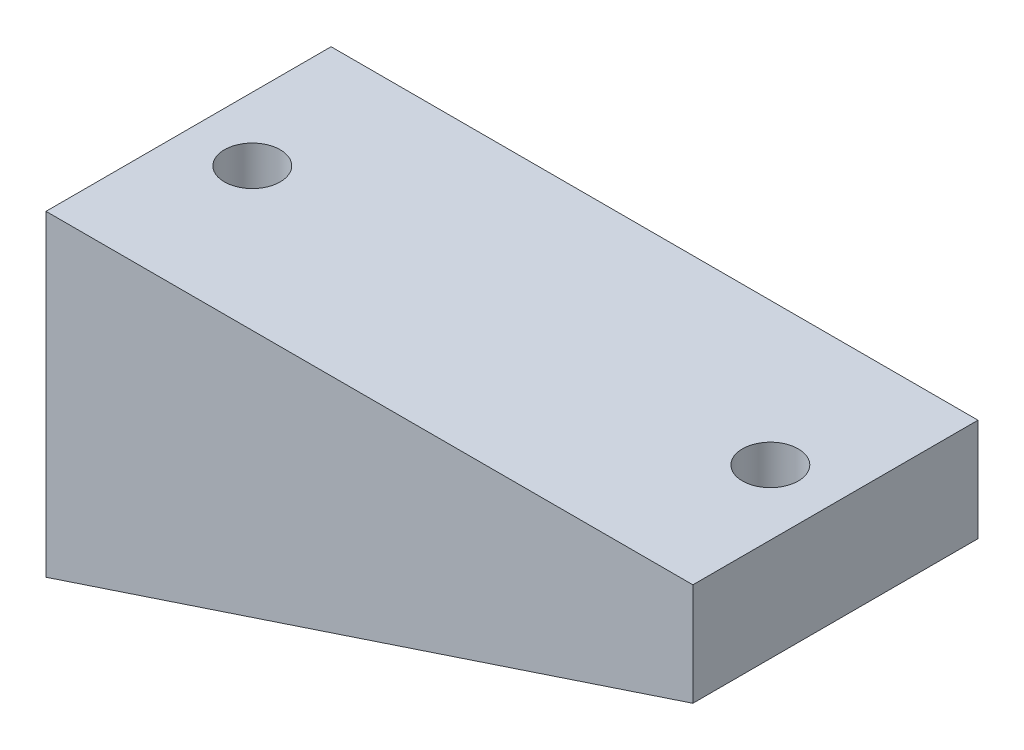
ISO-10303-21;
HEADER;
FILE_DESCRIPTION(('STEP AP214'),'2;1');
FILE_NAME('part.step','',(''),(''),'','','');
FILE_SCHEMA(('AUTOMOTIVE_DESIGN { 1 0 10303 214 1 1 1 1 }'));
ENDSEC;
DATA;
#1=APPLICATION_CONTEXT('core data for automotive mechanical design processes');
#2=APPLICATION_PROTOCOL_DEFINITION('international standard','automotive_design',2000,#1);
#3=PRODUCT_CONTEXT('',#1,'mechanical');
#4=PRODUCT('Part','Part','',(#3));
#5=PRODUCT_RELATED_PRODUCT_CATEGORY('part','',(#4));
#6=PRODUCT_DEFINITION_FORMATION('','',#4);
#7=PRODUCT_DEFINITION_CONTEXT('part definition',#1,'design');
#8=PRODUCT_DEFINITION('design','',#6,#7);
#9=PRODUCT_DEFINITION_SHAPE('','',#8);
#10=(LENGTH_UNIT() NAMED_UNIT(*) SI_UNIT(.MILLI.,.METRE.));
#11=(NAMED_UNIT(*) PLANE_ANGLE_UNIT() SI_UNIT($,.RADIAN.));
#12=(NAMED_UNIT(*) SI_UNIT($,.STERADIAN.) SOLID_ANGLE_UNIT());
#13=UNCERTAINTY_MEASURE_WITH_UNIT(LENGTH_MEASURE(1.E-05),#10,'distance_accuracy_value','');
#14=(GEOMETRIC_REPRESENTATION_CONTEXT(3) GLOBAL_UNCERTAINTY_ASSIGNED_CONTEXT((#13)) GLOBAL_UNIT_ASSIGNED_CONTEXT((#10,
#11,#12)) REPRESENTATION_CONTEXT('',''));
#15=CARTESIAN_POINT('',(0.,0.,0.));
#16=DIRECTION('',(0.,0.,1.));
#17=DIRECTION('',(1.,0.,0.));
#18=AXIS2_PLACEMENT_3D('',#15,#16,#17);
#19=CARTESIAN_POINT('',(120.25046854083,58.9096385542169,26.5));
#20=DIRECTION('',(0.,-1.,0.));
#21=DIRECTION('',(1.,0.,0.));
#22=AXIS2_PLACEMENT_3D('',#19,#20,#21);
#23=PLANE('',#22);
#24=DIRECTION('',(-1.,0.,0.));
#25=VECTOR('',#24,1.);
#26=CARTESIAN_POINT('',(120.25046854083,58.9096385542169,-26.5));
#27=LINE('',#26,#25);
#28=CARTESIAN_POINT('',(120.25046854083,58.9096385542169,-26.5));
#29=VERTEX_POINT('',#28);
#30=CARTESIAN_POINT('',(0.,58.9096385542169,-26.5));
#31=VERTEX_POINT('',#30);
#32=EDGE_CURVE('E102',#29,#31,#27,.T.);
#33=ORIENTED_EDGE('',*,*,#32,.T.);
#34=DIRECTION('',(0.,0.,-1.));
#35=VECTOR('',#34,1.);
#36=CARTESIAN_POINT('',(0.,58.9096385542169,26.5));
#37=LINE('',#36,#35);
#38=CARTESIAN_POINT('',(0.,58.9096385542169,26.5));
#39=VERTEX_POINT('',#38);
#40=EDGE_CURVE('E93',#39,#31,#37,.T.);
#41=ORIENTED_EDGE('',*,*,#40,.F.);
#42=DIRECTION('',(-1.,0.,0.));
#43=VECTOR('',#42,1.);
#44=CARTESIAN_POINT('',(120.25046854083,58.9096385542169,26.5));
#45=LINE('',#44,#43);
#46=CARTESIAN_POINT('',(120.25046854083,58.9096385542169,26.5));
#47=VERTEX_POINT('',#46);
#48=EDGE_CURVE('E51',#47,#39,#45,.T.);
#49=ORIENTED_EDGE('',*,*,#48,.F.);
#50=DIRECTION('',(0.,0.,-1.));
#51=VECTOR('',#50,1.);
#52=CARTESIAN_POINT('',(120.25046854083,58.9096385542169,26.5));
#53=LINE('',#52,#51);
#54=EDGE_CURVE('E110',#47,#29,#53,.T.);
#55=ORIENTED_EDGE('',*,*,#54,.T.);
#56=EDGE_LOOP('',(#33,#41,#49,#55));
#57=FACE_BOUND('',#56,.T.);
#58=CARTESIAN_POINT('',(108.150298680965,58.9096385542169,0.));
#59=DIRECTION('',(0.,1.,0.));
#60=DIRECTION('',(-1.,0.,0.));
#61=AXIS2_PLACEMENT_3D('',#58,#59,#60);
#62=CIRCLE('',#61,5.18706468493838);
#63=CARTESIAN_POINT('',(102.963233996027,58.9096385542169,0.));
#64=VERTEX_POINT('',#63);
#65=EDGE_CURVE('E97',#64,#64,#62,.T.);
#66=ORIENTED_EDGE('',*,*,#65,.F.);
#67=EDGE_LOOP('',(#66));
#68=FACE_BOUND('',#67,.T.);
#69=CARTESIAN_POINT('',(11.8497013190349,58.9096385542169,0.));
#70=DIRECTION('',(0.,-1.,0.));
#71=DIRECTION('',(1.,0.,0.));
#72=AXIS2_PLACEMENT_3D('',#69,#70,#71);
#73=CIRCLE('',#72,5.18706468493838);
#74=CARTESIAN_POINT('',(17.0367660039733,58.9096385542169,0.));
#75=VERTEX_POINT('',#74);
#76=EDGE_CURVE('E200',#75,#75,#73,.T.);
#77=ORIENTED_EDGE('',*,*,#76,.T.);
#78=EDGE_LOOP('',(#77));
#79=FACE_BOUND('',#78,.T.);
#80=ADVANCED_FACE('F36',(#57,#68,#79),#23,.F.);
#81=CARTESIAN_POINT('',(0.,58.9096385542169,26.5));
#82=DIRECTION('',(1.,0.,0.));
#83=DIRECTION('',(0.,0.,-1.));
#84=AXIS2_PLACEMENT_3D('',#81,#82,#83);
#85=PLANE('',#84);
#86=DIRECTION('',(0.,-1.,0.));
#87=VECTOR('',#86,1.);
#88=CARTESIAN_POINT('',(0.,58.9096385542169,-26.5));
#89=LINE('',#88,#87);
#90=CARTESIAN_POINT('',(0.,0.,-26.5));
#91=VERTEX_POINT('',#90);
#92=EDGE_CURVE('E81',#31,#91,#89,.T.);
#93=ORIENTED_EDGE('',*,*,#92,.T.);
#94=DIRECTION('',(0.,0.,-1.));
#95=VECTOR('',#94,1.);
#96=CARTESIAN_POINT('',(0.,0.,26.5));
#97=LINE('',#96,#95);
#98=CARTESIAN_POINT('',(0.,0.,26.5));
#99=VERTEX_POINT('',#98);
#100=EDGE_CURVE('E12',#99,#91,#97,.T.);
#101=ORIENTED_EDGE('',*,*,#100,.F.);
#102=DIRECTION('',(0.,-1.,0.));
#103=VECTOR('',#102,1.);
#104=CARTESIAN_POINT('',(0.,58.9096385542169,26.5));
#105=LINE('',#104,#103);
#106=EDGE_CURVE('E104',#39,#99,#105,.T.);
#107=ORIENTED_EDGE('',*,*,#106,.F.);
#108=ORIENTED_EDGE('',*,*,#40,.T.);
#109=EDGE_LOOP('',(#93,#101,#107,#108));
#110=FACE_BOUND('',#109,.T.);
#111=ADVANCED_FACE('F38',(#110),#85,.F.);
#112=CARTESIAN_POINT('',(0.,0.,26.5));
#113=DIRECTION('',(-0.314455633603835,0.949272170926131,0.));
#114=DIRECTION('',(-0.949272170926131,-0.314455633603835,0.));
#115=AXIS2_PLACEMENT_3D('',#112,#113,#114);
#116=PLANE('',#115);
#117=DIRECTION('',(0.949272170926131,0.314455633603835,0.));
#118=VECTOR('',#117,1.);
#119=CARTESIAN_POINT('',(0.,0.,-26.5));
#120=LINE('',#119,#118);
#121=CARTESIAN_POINT('',(120.25046854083,39.8341365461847,-26.5));
#122=VERTEX_POINT('',#121);
#123=EDGE_CURVE('E77',#91,#122,#120,.T.);
#124=ORIENTED_EDGE('',*,*,#123,.T.);
#125=DIRECTION('',(0.,0.,-1.));
#126=VECTOR('',#125,1.);
#127=CARTESIAN_POINT('',(120.25046854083,39.8341365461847,26.5));
#128=LINE('',#127,#126);
#129=CARTESIAN_POINT('',(120.25046854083,39.8341365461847,26.5));
#130=VERTEX_POINT('',#129);
#131=EDGE_CURVE('E44',#130,#122,#128,.T.);
#132=ORIENTED_EDGE('',*,*,#131,.F.);
#133=DIRECTION('',(0.949272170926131,0.314455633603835,0.));
#134=VECTOR('',#133,1.);
#135=CARTESIAN_POINT('',(0.,0.,26.5));
#136=LINE('',#135,#134);
#137=EDGE_CURVE('E89',#99,#130,#136,.T.);
#138=ORIENTED_EDGE('',*,*,#137,.F.);
#139=ORIENTED_EDGE('',*,*,#100,.T.);
#140=EDGE_LOOP('',(#124,#132,#138,#139));
#141=FACE_BOUND('',#140,.T.);
#142=ADVANCED_FACE('F88',(#141),#116,.F.);
#143=CARTESIAN_POINT('',(120.25046854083,39.8341365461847,26.5));
#144=DIRECTION('',(-1.,0.,0.));
#145=DIRECTION('',(0.,0.,1.));
#146=AXIS2_PLACEMENT_3D('',#143,#144,#145);
#147=PLANE('',#146);
#148=DIRECTION('',(0.,1.,0.));
#149=VECTOR('',#148,1.);
#150=CARTESIAN_POINT('',(120.25046854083,39.8341365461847,-26.5));
#151=LINE('',#150,#149);
#152=EDGE_CURVE('E82',#122,#29,#151,.T.);
#153=ORIENTED_EDGE('',*,*,#152,.T.);
#154=ORIENTED_EDGE('',*,*,#54,.F.);
#155=DIRECTION('',(0.,1.,0.));
#156=VECTOR('',#155,1.);
#157=CARTESIAN_POINT('',(120.25046854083,39.8341365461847,26.5));
#158=LINE('',#157,#156);
#159=EDGE_CURVE('E56',#130,#47,#158,.T.);
#160=ORIENTED_EDGE('',*,*,#159,.F.);
#161=ORIENTED_EDGE('',*,*,#131,.T.);
#162=EDGE_LOOP('',(#153,#154,#160,#161));
#163=FACE_BOUND('',#162,.T.);
#164=ADVANCED_FACE('F113',(#163),#147,.F.);
#165=CARTESIAN_POINT('',(0.,58.9096385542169,26.5));
#166=DIRECTION('',(0.,0.,-1.));
#167=DIRECTION('',(-1.,0.,0.));
#168=AXIS2_PLACEMENT_3D('',#165,#166,#167);
#169=PLANE('',#168);
#170=ORIENTED_EDGE('',*,*,#106,.T.);
#171=ORIENTED_EDGE('',*,*,#137,.T.);
#172=ORIENTED_EDGE('',*,*,#159,.T.);
#173=ORIENTED_EDGE('',*,*,#48,.T.);
#174=EDGE_LOOP('',(#170,#171,#172,#173));
#175=FACE_BOUND('',#174,.T.);
#176=ADVANCED_FACE('F116',(#175),#169,.F.);
#177=CARTESIAN_POINT('',(0.,58.9096385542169,-26.5));
#178=DIRECTION('',(0.,0.,-1.));
#179=DIRECTION('',(-1.,0.,0.));
#180=AXIS2_PLACEMENT_3D('',#177,#178,#179);
#181=PLANE('',#180);
#182=ORIENTED_EDGE('',*,*,#92,.F.);
#183=ORIENTED_EDGE('',*,*,#32,.F.);
#184=ORIENTED_EDGE('',*,*,#152,.F.);
#185=ORIENTED_EDGE('',*,*,#123,.F.);
#186=EDGE_LOOP('',(#182,#183,#184,#185));
#187=FACE_BOUND('',#186,.T.);
#188=ADVANCED_FACE('F78',(#187),#181,.T.);
#189=CARTESIAN_POINT('',(108.150298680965,21.0297909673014,0.));
#190=DIRECTION('',(0.,1.,0.));
#191=DIRECTION('',(-1.,0.,0.));
#192=AXIS2_PLACEMENT_3D('',#189,#190,#191);
#193=CYLINDRICAL_SURFACE('',#192,5.18706468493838);
#194=CARTESIAN_POINT('',(108.150298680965,41.0930309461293,0.));
#195=DIRECTION('',(-0.314455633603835,0.949272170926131,0.));
#196=DIRECTION('',(0.949272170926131,0.314455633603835,0.));
#197=AXIS2_PLACEMENT_3D('',#194,#195,#196);
#198=ELLIPSE('',#197,5.4642544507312,5.18706468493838);
#199=CARTESIAN_POINT('',(113.337363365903,42.8112965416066,0.));
#200=VERTEX_POINT('',#199);
#201=EDGE_CURVE('E94',#200,#200,#198,.F.);
#202=ORIENTED_EDGE('',*,*,#201,.T.);
#203=EDGE_LOOP('',(#202));
#204=FACE_BOUND('',#203,.T.);
#205=ORIENTED_EDGE('',*,*,#65,.T.);
#206=EDGE_LOOP('',(#205));
#207=FACE_BOUND('',#206,.T.);
#208=ADVANCED_FACE('F123',(#204,#207),#193,.F.);
#209=CARTESIAN_POINT('',(-1.57227816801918,4.74636085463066,26.5));
#210=DIRECTION('',(-0.314455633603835,0.949272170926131,0.));
#211=DIRECTION('',(-0.949272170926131,-0.314455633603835,0.));
#212=AXIS2_PLACEMENT_3D('',#209,#210,#211);
#213=PLANE('',#212);
#214=ORIENTED_EDGE('',*,*,#201,.F.);
#215=EDGE_LOOP('',(#214));
#216=FACE_BOUND('',#215,.T.);
#217=ADVANCED_FACE('F159',(#216),#213,.T.);
#218=CARTESIAN_POINT('',(11.8497013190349,-10.8707179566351,0.));
#219=DIRECTION('',(0.,1.,0.));
#220=DIRECTION('',(-1.,0.,0.));
#221=AXIS2_PLACEMENT_3D('',#218,#219,#220);
#222=CYLINDRICAL_SURFACE('',#221,5.18706468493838);
#223=CARTESIAN_POINT('',(11.8497013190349,9.1925220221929,0.));
#224=DIRECTION('',(-0.314455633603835,0.949272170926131,0.));
#225=DIRECTION('',(0.949272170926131,0.314455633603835,0.));
#226=AXIS2_PLACEMENT_3D('',#223,#224,#225);
#227=ELLIPSE('',#226,5.4642544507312,5.18706468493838);
#228=CARTESIAN_POINT('',(17.0367660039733,10.9107876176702,0.));
#229=VERTEX_POINT('',#228);
#230=EDGE_CURVE('E199',#229,#229,#227,.T.);
#231=ORIENTED_EDGE('',*,*,#230,.F.);
#232=EDGE_LOOP('',(#231));
#233=FACE_BOUND('',#232,.T.);
#234=ORIENTED_EDGE('',*,*,#76,.F.);
#235=EDGE_LOOP('',(#234));
#236=FACE_BOUND('',#235,.T.);
#237=ADVANCED_FACE('F168',(#233,#236),#222,.F.);
#238=CARTESIAN_POINT('',(-1.57227816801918,4.74636085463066,26.5));
#239=DIRECTION('',(-0.314455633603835,0.949272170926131,0.));
#240=DIRECTION('',(-0.949272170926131,-0.314455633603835,0.));
#241=AXIS2_PLACEMENT_3D('',#238,#239,#240);
#242=PLANE('',#241);
#243=ORIENTED_EDGE('',*,*,#230,.T.);
#244=EDGE_LOOP('',(#243));
#245=FACE_BOUND('',#244,.T.);
#246=ADVANCED_FACE('F183',(#245),#242,.T.);
#247=CLOSED_SHELL('',(#80,#111,#142,#164,#176,#188,#208,#217,#237,#246));
#248=MANIFOLD_SOLID_BREP('B2',#247);
#249=ADVANCED_BREP_SHAPE_REPRESENTATION('',(#18,#248),#14);
#250=SHAPE_DEFINITION_REPRESENTATION(#9,#249);
ENDSEC;
END-ISO-10303-21;
